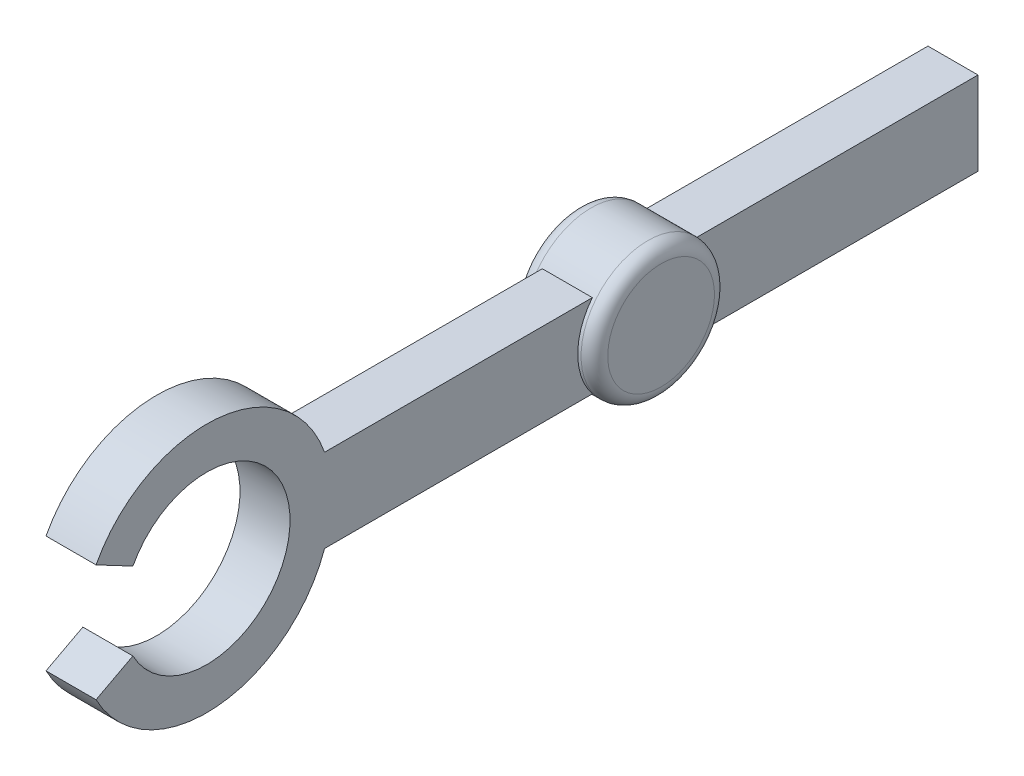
ISO-10303-21;
HEADER;
FILE_DESCRIPTION(('STEP AP214'),'2;1');
FILE_NAME('part.step','',(''),(''),'','','');
FILE_SCHEMA(('AUTOMOTIVE_DESIGN { 1 0 10303 214 1 1 1 1 }'));
ENDSEC;
DATA;
#1=APPLICATION_CONTEXT('core data for automotive mechanical design processes');
#2=APPLICATION_PROTOCOL_DEFINITION('international standard','automotive_design',2000,#1);
#3=PRODUCT_CONTEXT('',#1,'mechanical');
#4=PRODUCT('Part','Part','',(#3));
#5=PRODUCT_RELATED_PRODUCT_CATEGORY('part','',(#4));
#6=PRODUCT_DEFINITION_FORMATION('','',#4);
#7=PRODUCT_DEFINITION_CONTEXT('part definition',#1,'design');
#8=PRODUCT_DEFINITION('design','',#6,#7);
#9=PRODUCT_DEFINITION_SHAPE('','',#8);
#10=(LENGTH_UNIT() NAMED_UNIT(*) SI_UNIT(.MILLI.,.METRE.));
#11=(NAMED_UNIT(*) PLANE_ANGLE_UNIT() SI_UNIT($,.RADIAN.));
#12=(NAMED_UNIT(*) SI_UNIT($,.STERADIAN.) SOLID_ANGLE_UNIT());
#13=UNCERTAINTY_MEASURE_WITH_UNIT(LENGTH_MEASURE(1.E-05),#10,'distance_accuracy_value','');
#14=(GEOMETRIC_REPRESENTATION_CONTEXT(3) GLOBAL_UNCERTAINTY_ASSIGNED_CONTEXT((#13)) GLOBAL_UNIT_ASSIGNED_CONTEXT((#10,
#11,#12)) REPRESENTATION_CONTEXT('',''));
#15=CARTESIAN_POINT('',(0.,0.,0.));
#16=DIRECTION('',(0.,0.,1.));
#17=DIRECTION('',(1.,0.,0.));
#18=AXIS2_PLACEMENT_3D('',#15,#16,#17);
#19=CARTESIAN_POINT('',(-3.81,6.35,-50.8));
#20=DIRECTION('',(0.,1.,0.));
#21=DIRECTION('',(0.,0.,1.));
#22=AXIS2_PLACEMENT_3D('',#19,#20,#21);
#23=PLANE('',#22);
#24=DIRECTION('',(0.,0.,1.));
#25=VECTOR('',#24,1.);
#26=CARTESIAN_POINT('',(-3.81,6.35,-50.8));
#27=LINE('',#26,#25);
#28=CARTESIAN_POINT('',(-3.81,6.35,7.93114745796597));
#29=VERTEX_POINT('',#28);
#30=CARTESIAN_POINT('',(-3.81,6.35,48.7144877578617));
#31=VERTEX_POINT('',#30);
#32=EDGE_CURVE('E183',#29,#31,#27,.T.);
#33=ORIENTED_EDGE('',*,*,#32,.T.);
#34=DIRECTION('',(-1.,0.,0.));
#35=VECTOR('',#34,1.);
#36=CARTESIAN_POINT('',(3.81,6.35,48.7144877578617));
#37=LINE('',#36,#35);
#38=CARTESIAN_POINT('',(3.81,6.35,48.7144877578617));
#39=VERTEX_POINT('',#38);
#40=EDGE_CURVE('E155',#31,#39,#37,.F.);
#41=ORIENTED_EDGE('',*,*,#40,.T.);
#42=DIRECTION('',(0.,0.,1.));
#43=VECTOR('',#42,1.);
#44=CARTESIAN_POINT('',(3.81,6.35,-50.8));
#45=LINE('',#44,#43);
#46=CARTESIAN_POINT('',(3.81,6.35,7.93114745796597));
#47=VERTEX_POINT('',#46);
#48=EDGE_CURVE('E64',#47,#39,#45,.T.);
#49=ORIENTED_EDGE('',*,*,#48,.F.);
#50=DIRECTION('',(-1.,0.,0.));
#51=VECTOR('',#50,1.);
#52=CARTESIAN_POINT('',(6.35,6.35,7.93114745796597));
#53=LINE('',#52,#51);
#54=EDGE_CURVE('E176',#29,#47,#53,.F.);
#55=ORIENTED_EDGE('',*,*,#54,.F.);
#56=EDGE_LOOP('',(#33,#41,#49,#55));
#57=FACE_BOUND('',#56,.T.);
#58=ADVANCED_FACE('F41',(#57),#23,.T.);
#59=CARTESIAN_POINT('',(-3.81,-6.35,-50.8));
#60=DIRECTION('',(0.,-1.,0.));
#61=DIRECTION('',(0.,0.,-1.));
#62=AXIS2_PLACEMENT_3D('',#59,#60,#61);
#63=PLANE('',#62);
#64=DIRECTION('',(0.,0.,1.));
#65=VECTOR('',#64,1.);
#66=CARTESIAN_POINT('',(3.81,-6.35,-50.8));
#67=LINE('',#66,#65);
#68=CARTESIAN_POINT('',(3.81,-6.35,7.93114745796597));
#69=VERTEX_POINT('',#68);
#70=CARTESIAN_POINT('',(3.81,-6.35,48.7144877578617));
#71=VERTEX_POINT('',#70);
#72=EDGE_CURVE('E177',#69,#71,#67,.T.);
#73=ORIENTED_EDGE('',*,*,#72,.T.);
#74=DIRECTION('',(-1.,0.,0.));
#75=VECTOR('',#74,1.);
#76=CARTESIAN_POINT('',(3.81,-6.35,48.7144877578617));
#77=LINE('',#76,#75);
#78=CARTESIAN_POINT('',(-3.81,-6.35,48.7144877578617));
#79=VERTEX_POINT('',#78);
#80=EDGE_CURVE('E152',#71,#79,#77,.T.);
#81=ORIENTED_EDGE('',*,*,#80,.T.);
#82=DIRECTION('',(0.,0.,1.));
#83=VECTOR('',#82,1.);
#84=CARTESIAN_POINT('',(-3.81,-6.35,-50.8));
#85=LINE('',#84,#83);
#86=CARTESIAN_POINT('',(-3.81,-6.35,7.93114745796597));
#87=VERTEX_POINT('',#86);
#88=EDGE_CURVE('E181',#87,#79,#85,.T.);
#89=ORIENTED_EDGE('',*,*,#88,.F.);
#90=DIRECTION('',(-1.,0.,0.));
#91=VECTOR('',#90,1.);
#92=CARTESIAN_POINT('',(6.35,-6.35,7.93114745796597));
#93=LINE('',#92,#91);
#94=EDGE_CURVE('E192',#69,#87,#93,.T.);
#95=ORIENTED_EDGE('',*,*,#94,.F.);
#96=EDGE_LOOP('',(#73,#81,#89,#95));
#97=FACE_BOUND('',#96,.T.);
#98=ADVANCED_FACE('F226',(#97),#63,.T.);
#99=CARTESIAN_POINT('',(6.35,0.,0.));
#100=DIRECTION('',(-1.,0.,0.));
#101=DIRECTION('',(0.,0.,1.));
#102=AXIS2_PLACEMENT_3D('',#99,#100,#101);
#103=CYLINDRICAL_SURFACE('',#102,10.16);
#104=CARTESIAN_POINT('',(-4.318,0.,0.));
#105=DIRECTION('',(1.,0.,0.));
#106=DIRECTION('',(0.,0.,-1.));
#107=AXIS2_PLACEMENT_3D('',#104,#105,#106);
#108=CIRCLE('',#107,10.16);
#109=CARTESIAN_POINT('',(-4.318,0.,-10.16));
#110=VERTEX_POINT('',#109);
#111=EDGE_CURVE('E209',#110,#110,#108,.T.);
#112=ORIENTED_EDGE('',*,*,#111,.T.);
#113=EDGE_LOOP('',(#112));
#114=FACE_BOUND('',#113,.T.);
#115=CARTESIAN_POINT('',(4.318,0.,0.));
#116=DIRECTION('',(1.,0.,0.));
#117=DIRECTION('',(0.,0.,-1.));
#118=AXIS2_PLACEMENT_3D('',#115,#116,#117);
#119=CIRCLE('',#118,10.16);
#120=CARTESIAN_POINT('',(4.318,0.,-10.16));
#121=VERTEX_POINT('',#120);
#122=EDGE_CURVE('E206',#121,#121,#119,.F.);
#123=ORIENTED_EDGE('',*,*,#122,.T.);
#124=EDGE_LOOP('',(#123));
#125=FACE_BOUND('',#124,.T.);
#126=DIRECTION('',(-1.,0.,0.));
#127=VECTOR('',#126,1.);
#128=CARTESIAN_POINT('',(6.35,-6.35,-7.93114745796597));
#129=LINE('',#128,#127);
#130=CARTESIAN_POINT('',(-3.81,-6.35,-7.93114745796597));
#131=VERTEX_POINT('',#130);
#132=CARTESIAN_POINT('',(3.81,-6.35,-7.93114745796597));
#133=VERTEX_POINT('',#132);
#134=EDGE_CURVE('E203',#131,#133,#129,.F.);
#135=ORIENTED_EDGE('',*,*,#134,.T.);
#136=CARTESIAN_POINT('',(3.81,0.,0.));
#137=DIRECTION('',(1.,0.,0.));
#138=DIRECTION('',(0.,1.,0.));
#139=AXIS2_PLACEMENT_3D('',#136,#137,#138);
#140=CIRCLE('',#139,10.16);
#141=CARTESIAN_POINT('',(3.81,6.35,-7.93114745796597));
#142=VERTEX_POINT('',#141);
#143=EDGE_CURVE('E200',#133,#142,#140,.T.);
#144=ORIENTED_EDGE('',*,*,#143,.T.);
#145=DIRECTION('',(-1.,0.,0.));
#146=VECTOR('',#145,1.);
#147=CARTESIAN_POINT('',(6.35,6.35,-7.93114745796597));
#148=LINE('',#147,#146);
#149=CARTESIAN_POINT('',(-3.81,6.35,-7.93114745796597));
#150=VERTEX_POINT('',#149);
#151=EDGE_CURVE('E199',#142,#150,#148,.T.);
#152=ORIENTED_EDGE('',*,*,#151,.T.);
#153=CARTESIAN_POINT('',(-3.81,0.,0.));
#154=DIRECTION('',(-1.,0.,0.));
#155=DIRECTION('',(0.,-1.,0.));
#156=AXIS2_PLACEMENT_3D('',#153,#154,#155);
#157=CIRCLE('',#156,10.16);
#158=EDGE_CURVE('E193',#150,#131,#157,.T.);
#159=ORIENTED_EDGE('',*,*,#158,.T.);
#160=EDGE_LOOP('',(#135,#144,#152,#159));
#161=FACE_BOUND('',#160,.T.);
#162=ORIENTED_EDGE('',*,*,#54,.T.);
#163=EDGE_CURVE('E196',#47,#69,#140,.T.);
#164=ORIENTED_EDGE('',*,*,#163,.T.);
#165=ORIENTED_EDGE('',*,*,#94,.T.);
#166=EDGE_CURVE('E189',#87,#29,#157,.T.);
#167=ORIENTED_EDGE('',*,*,#166,.T.);
#168=EDGE_LOOP('',(#162,#164,#165,#167));
#169=FACE_BOUND('',#168,.T.);
#170=ADVANCED_FACE('F222',(#114,#125,#161,#169),#103,.T.);
#171=CARTESIAN_POINT('',(6.35,0.,0.));
#172=DIRECTION('',(1.,0.,0.));
#173=DIRECTION('',(0.,0.,-1.));
#174=AXIS2_PLACEMENT_3D('',#171,#172,#173);
#175=PLANE('',#174);
#176=CARTESIAN_POINT('',(6.35,0.,0.));
#177=DIRECTION('',(1.,0.,0.));
#178=DIRECTION('',(0.,0.,-1.));
#179=AXIS2_PLACEMENT_3D('',#176,#177,#178);
#180=CIRCLE('',#179,8.128);
#181=CARTESIAN_POINT('',(6.35,0.,-8.128));
#182=VERTEX_POINT('',#181);
#183=EDGE_CURVE('E11',#182,#182,#180,.T.);
#184=ORIENTED_EDGE('',*,*,#183,.T.);
#185=EDGE_LOOP('',(#184));
#186=FACE_BOUND('',#185,.T.);
#187=ADVANCED_FACE('F225',(#186),#175,.T.);
#188=CARTESIAN_POINT('',(-6.35,0.,0.));
#189=DIRECTION('',(1.,0.,0.));
#190=DIRECTION('',(0.,0.,-1.));
#191=AXIS2_PLACEMENT_3D('',#188,#189,#190);
#192=PLANE('',#191);
#193=CARTESIAN_POINT('',(-6.35,0.,0.));
#194=DIRECTION('',(1.,0.,0.));
#195=DIRECTION('',(0.,0.,-1.));
#196=AXIS2_PLACEMENT_3D('',#193,#194,#195);
#197=CIRCLE('',#196,8.128);
#198=CARTESIAN_POINT('',(-6.35,0.,-8.128));
#199=VERTEX_POINT('',#198);
#200=EDGE_CURVE('E49',#199,#199,#197,.F.);
#201=ORIENTED_EDGE('',*,*,#200,.T.);
#202=EDGE_LOOP('',(#201));
#203=FACE_BOUND('',#202,.T.);
#204=ADVANCED_FACE('F214',(#203),#192,.F.);
#205=CARTESIAN_POINT('',(-3.81,6.35,-50.8));
#206=DIRECTION('',(-1.,0.,0.));
#207=DIRECTION('',(0.,-1.,0.));
#208=AXIS2_PLACEMENT_3D('',#205,#206,#207);
#209=PLANE('',#208);
#210=CARTESIAN_POINT('',(-3.81,0.,66.675));
#211=DIRECTION('',(1.,0.,0.));
#212=DIRECTION('',(0.,0.,-1.));
#213=AXIS2_PLACEMENT_3D('',#210,#211,#212);
#214=CIRCLE('',#213,19.05);
#215=CARTESIAN_POINT('',(-3.81,8.88999999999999,83.5234539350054));
#216=VERTEX_POINT('',#215);
#217=EDGE_CURVE('E150',#31,#216,#214,.T.);
#218=ORIENTED_EDGE('',*,*,#217,.F.);
#219=ORIENTED_EDGE('',*,*,#32,.F.);
#220=ORIENTED_EDGE('',*,*,#166,.F.);
#221=ORIENTED_EDGE('',*,*,#88,.T.);
#222=CARTESIAN_POINT('',(-3.81,-8.89,83.5234539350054));
#223=VERTEX_POINT('',#222);
#224=EDGE_CURVE('E241',#223,#79,#214,.T.);
#225=ORIENTED_EDGE('',*,*,#224,.F.);
#226=DIRECTION('',(0.,-0.466666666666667,0.884433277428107));
#227=VECTOR('',#226,1.);
#228=CARTESIAN_POINT('',(-3.81,-8.89,83.5234539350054));
#229=LINE('',#228,#227);
#230=CARTESIAN_POINT('',(-3.81,-5.92666666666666,77.9073026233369));
#231=VERTEX_POINT('',#230);
#232=EDGE_CURVE('E137',#231,#223,#229,.T.);
#233=ORIENTED_EDGE('',*,*,#232,.F.);
#234=CARTESIAN_POINT('',(-3.81,0.,66.675));
#235=DIRECTION('',(-1.,0.,0.));
#236=DIRECTION('',(0.,0.,-1.));
#237=AXIS2_PLACEMENT_3D('',#234,#235,#236);
#238=CIRCLE('',#237,12.7);
#239=CARTESIAN_POINT('',(-3.81,5.92666666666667,77.9073026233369));
#240=VERTEX_POINT('',#239);
#241=EDGE_CURVE('E248',#240,#231,#238,.T.);
#242=ORIENTED_EDGE('',*,*,#241,.F.);
#243=DIRECTION('',(0.,-0.466666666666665,-0.884433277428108));
#244=VECTOR('',#243,1.);
#245=CARTESIAN_POINT('',(-3.81,8.88999999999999,83.5234539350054));
#246=LINE('',#245,#244);
#247=EDGE_CURVE('E240',#216,#240,#246,.T.);
#248=ORIENTED_EDGE('',*,*,#247,.F.);
#249=EDGE_LOOP('',(#218,#219,#220,#221,#225,#233,#242,#248));
#250=FACE_BOUND('',#249,.T.);
#251=ADVANCED_FACE('F236',(#250),#209,.T.);
#252=CARTESIAN_POINT('',(3.81,6.35,-50.8));
#253=DIRECTION('',(1.,0.,0.));
#254=DIRECTION('',(0.,1.,0.));
#255=AXIS2_PLACEMENT_3D('',#252,#253,#254);
#256=PLANE('',#255);
#257=ORIENTED_EDGE('',*,*,#48,.T.);
#258=CARTESIAN_POINT('',(3.81,0.,66.675));
#259=DIRECTION('',(1.,0.,0.));
#260=DIRECTION('',(0.,0.,-1.));
#261=AXIS2_PLACEMENT_3D('',#258,#259,#260);
#262=CIRCLE('',#261,19.05);
#263=CARTESIAN_POINT('',(3.81,8.88999999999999,83.5234539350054));
#264=VERTEX_POINT('',#263);
#265=EDGE_CURVE('E129',#39,#264,#262,.T.);
#266=ORIENTED_EDGE('',*,*,#265,.T.);
#267=DIRECTION('',(0.,-0.466666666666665,-0.884433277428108));
#268=VECTOR('',#267,1.);
#269=CARTESIAN_POINT('',(3.81,8.88999999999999,83.5234539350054));
#270=LINE('',#269,#268);
#271=CARTESIAN_POINT('',(3.81,5.92666666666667,77.9073026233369));
#272=VERTEX_POINT('',#271);
#273=EDGE_CURVE('E132',#264,#272,#270,.T.);
#274=ORIENTED_EDGE('',*,*,#273,.T.);
#275=CARTESIAN_POINT('',(3.81,0.,66.675));
#276=DIRECTION('',(-1.,0.,0.));
#277=DIRECTION('',(0.,0.,-1.));
#278=AXIS2_PLACEMENT_3D('',#275,#276,#277);
#279=CIRCLE('',#278,12.7);
#280=CARTESIAN_POINT('',(3.81,-5.92666666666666,77.9073026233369));
#281=VERTEX_POINT('',#280);
#282=EDGE_CURVE('E146',#272,#281,#279,.T.);
#283=ORIENTED_EDGE('',*,*,#282,.T.);
#284=DIRECTION('',(0.,-0.466666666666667,0.884433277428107));
#285=VECTOR('',#284,1.);
#286=CARTESIAN_POINT('',(3.81,-8.89,83.5234539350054));
#287=LINE('',#286,#285);
#288=CARTESIAN_POINT('',(3.81,-8.89,83.5234539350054));
#289=VERTEX_POINT('',#288);
#290=EDGE_CURVE('E245',#281,#289,#287,.T.);
#291=ORIENTED_EDGE('',*,*,#290,.T.);
#292=EDGE_CURVE('E136',#289,#71,#262,.T.);
#293=ORIENTED_EDGE('',*,*,#292,.T.);
#294=ORIENTED_EDGE('',*,*,#72,.F.);
#295=ORIENTED_EDGE('',*,*,#163,.F.);
#296=EDGE_LOOP('',(#257,#266,#274,#283,#291,#293,#294,#295));
#297=FACE_BOUND('',#296,.T.);
#298=ADVANCED_FACE('F131',(#297),#256,.T.);
#299=ORIENTED_EDGE('',*,*,#134,.F.);
#300=CARTESIAN_POINT('',(-3.81,-6.35,-50.8));
#301=VERTEX_POINT('',#300);
#302=EDGE_CURVE('E178',#301,#131,#85,.T.);
#303=ORIENTED_EDGE('',*,*,#302,.F.);
#304=DIRECTION('',(1.,0.,0.));
#305=VECTOR('',#304,1.);
#306=CARTESIAN_POINT('',(-3.81,-6.35,-50.8));
#307=LINE('',#306,#305);
#308=CARTESIAN_POINT('',(3.81,-6.35,-50.8));
#309=VERTEX_POINT('',#308);
#310=EDGE_CURVE('E170',#301,#309,#307,.T.);
#311=ORIENTED_EDGE('',*,*,#310,.T.);
#312=EDGE_CURVE('E173',#309,#133,#67,.T.);
#313=ORIENTED_EDGE('',*,*,#312,.T.);
#314=EDGE_LOOP('',(#299,#303,#311,#313));
#315=FACE_BOUND('',#314,.T.);
#316=ADVANCED_FACE('F286',(#315),#63,.T.);
#317=ORIENTED_EDGE('',*,*,#151,.F.);
#318=CARTESIAN_POINT('',(3.81,6.35,-50.8));
#319=VERTEX_POINT('',#318);
#320=EDGE_CURVE('E184',#319,#142,#45,.T.);
#321=ORIENTED_EDGE('',*,*,#320,.F.);
#322=DIRECTION('',(-1.,0.,0.));
#323=VECTOR('',#322,1.);
#324=CARTESIAN_POINT('',(-3.81,6.35,-50.8));
#325=LINE('',#324,#323);
#326=CARTESIAN_POINT('',(-3.81,6.35,-50.8));
#327=VERTEX_POINT('',#326);
#328=EDGE_CURVE('E165',#319,#327,#325,.T.);
#329=ORIENTED_EDGE('',*,*,#328,.T.);
#330=EDGE_CURVE('E56',#327,#150,#27,.T.);
#331=ORIENTED_EDGE('',*,*,#330,.T.);
#332=EDGE_LOOP('',(#317,#321,#329,#331));
#333=FACE_BOUND('',#332,.T.);
#334=ADVANCED_FACE('F280',(#333),#23,.T.);
#335=ORIENTED_EDGE('',*,*,#143,.F.);
#336=ORIENTED_EDGE('',*,*,#312,.F.);
#337=DIRECTION('',(0.,1.,0.));
#338=VECTOR('',#337,1.);
#339=CARTESIAN_POINT('',(3.81,6.35,-50.8));
#340=LINE('',#339,#338);
#341=EDGE_CURVE('E162',#309,#319,#340,.T.);
#342=ORIENTED_EDGE('',*,*,#341,.T.);
#343=ORIENTED_EDGE('',*,*,#320,.T.);
#344=EDGE_LOOP('',(#335,#336,#342,#343));
#345=FACE_BOUND('',#344,.T.);
#346=ADVANCED_FACE('F290',(#345),#256,.T.);
#347=ORIENTED_EDGE('',*,*,#158,.F.);
#348=ORIENTED_EDGE('',*,*,#330,.F.);
#349=DIRECTION('',(0.,-1.,0.));
#350=VECTOR('',#349,1.);
#351=CARTESIAN_POINT('',(-3.81,6.35,-50.8));
#352=LINE('',#351,#350);
#353=EDGE_CURVE('E167',#327,#301,#352,.T.);
#354=ORIENTED_EDGE('',*,*,#353,.T.);
#355=ORIENTED_EDGE('',*,*,#302,.T.);
#356=EDGE_LOOP('',(#347,#348,#354,#355));
#357=FACE_BOUND('',#356,.T.);
#358=ADVANCED_FACE('F295',(#357),#209,.T.);
#359=CARTESIAN_POINT('',(0.,0.,-50.8));
#360=DIRECTION('',(0.,0.,1.));
#361=DIRECTION('',(1.,0.,0.));
#362=AXIS2_PLACEMENT_3D('',#359,#360,#361);
#363=PLANE('',#362);
#364=ORIENTED_EDGE('',*,*,#341,.F.);
#365=ORIENTED_EDGE('',*,*,#310,.F.);
#366=ORIENTED_EDGE('',*,*,#353,.F.);
#367=ORIENTED_EDGE('',*,*,#328,.F.);
#368=EDGE_LOOP('',(#364,#365,#366,#367));
#369=FACE_BOUND('',#368,.T.);
#370=ADVANCED_FACE('F219',(#369),#363,.F.);
#371=CARTESIAN_POINT('',(-4.318,0.,0.));
#372=DIRECTION('',(1.,0.,0.));
#373=DIRECTION('',(0.,0.,-1.));
#374=AXIS2_PLACEMENT_3D('',#371,#372,#373);
#375=TOROIDAL_SURFACE('',#374,8.128,2.032);
#376=ORIENTED_EDGE('',*,*,#200,.F.);
#377=EDGE_LOOP('',(#376));
#378=FACE_BOUND('',#377,.T.);
#379=ORIENTED_EDGE('',*,*,#111,.F.);
#380=EDGE_LOOP('',(#379));
#381=FACE_BOUND('',#380,.T.);
#382=ADVANCED_FACE('F216',(#378,#381),#375,.T.);
#383=CARTESIAN_POINT('',(4.318,0.,0.));
#384=DIRECTION('',(1.,0.,0.));
#385=DIRECTION('',(0.,0.,-1.));
#386=AXIS2_PLACEMENT_3D('',#383,#384,#385);
#387=TOROIDAL_SURFACE('',#386,8.128,2.032);
#388=ORIENTED_EDGE('',*,*,#122,.F.);
#389=EDGE_LOOP('',(#388));
#390=FACE_BOUND('',#389,.T.);
#391=ORIENTED_EDGE('',*,*,#183,.F.);
#392=EDGE_LOOP('',(#391));
#393=FACE_BOUND('',#392,.T.);
#394=ADVANCED_FACE('F43',(#390,#393),#387,.T.);
#395=CARTESIAN_POINT('',(3.81,0.,66.675));
#396=DIRECTION('',(-1.,0.,0.));
#397=DIRECTION('',(0.,0.,1.));
#398=AXIS2_PLACEMENT_3D('',#395,#396,#397);
#399=CYLINDRICAL_SURFACE('',#398,19.05);
#400=ORIENTED_EDGE('',*,*,#40,.F.);
#401=ORIENTED_EDGE('',*,*,#217,.T.);
#402=DIRECTION('',(-1.,0.,0.));
#403=VECTOR('',#402,1.);
#404=CARTESIAN_POINT('',(3.81,8.88999999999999,83.5234539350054));
#405=LINE('',#404,#403);
#406=EDGE_CURVE('E142',#264,#216,#405,.T.);
#407=ORIENTED_EDGE('',*,*,#406,.F.);
#408=ORIENTED_EDGE('',*,*,#265,.F.);
#409=EDGE_LOOP('',(#400,#401,#407,#408));
#410=FACE_BOUND('',#409,.T.);
#411=ADVANCED_FACE('F148',(#410),#399,.T.);
#412=ORIENTED_EDGE('',*,*,#80,.F.);
#413=ORIENTED_EDGE('',*,*,#292,.F.);
#414=DIRECTION('',(-1.,0.,0.));
#415=VECTOR('',#414,1.);
#416=CARTESIAN_POINT('',(3.81,-8.89,83.5234539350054));
#417=LINE('',#416,#415);
#418=EDGE_CURVE('E251',#289,#223,#417,.T.);
#419=ORIENTED_EDGE('',*,*,#418,.T.);
#420=ORIENTED_EDGE('',*,*,#224,.T.);
#421=EDGE_LOOP('',(#412,#413,#419,#420));
#422=FACE_BOUND('',#421,.T.);
#423=ADVANCED_FACE('F263',(#422),#399,.T.);
#424=CARTESIAN_POINT('',(3.81,8.88999999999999,83.5234539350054));
#425=DIRECTION('',(0.,0.884433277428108,-0.466666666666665));
#426=DIRECTION('',(0.,0.466666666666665,0.884433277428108));
#427=AXIS2_PLACEMENT_3D('',#424,#425,#426);
#428=PLANE('',#427);
#429=ORIENTED_EDGE('',*,*,#247,.T.);
#430=DIRECTION('',(-1.,0.,0.));
#431=VECTOR('',#430,1.);
#432=CARTESIAN_POINT('',(3.81,5.92666666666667,77.9073026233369));
#433=LINE('',#432,#431);
#434=EDGE_CURVE('E144',#272,#240,#433,.T.);
#435=ORIENTED_EDGE('',*,*,#434,.F.);
#436=ORIENTED_EDGE('',*,*,#273,.F.);
#437=ORIENTED_EDGE('',*,*,#406,.T.);
#438=EDGE_LOOP('',(#429,#435,#436,#437));
#439=FACE_BOUND('',#438,.T.);
#440=ADVANCED_FACE('F141',(#439),#428,.F.);
#441=CARTESIAN_POINT('',(3.81,0.,66.675));
#442=DIRECTION('',(-1.,0.,0.));
#443=DIRECTION('',(0.,0.,1.));
#444=AXIS2_PLACEMENT_3D('',#441,#442,#443);
#445=CYLINDRICAL_SURFACE('',#444,12.7);
#446=ORIENTED_EDGE('',*,*,#241,.T.);
#447=DIRECTION('',(-1.,0.,0.));
#448=VECTOR('',#447,1.);
#449=CARTESIAN_POINT('',(3.81,-5.92666666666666,77.9073026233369));
#450=LINE('',#449,#448);
#451=EDGE_CURVE('E157',#281,#231,#450,.T.);
#452=ORIENTED_EDGE('',*,*,#451,.F.);
#453=ORIENTED_EDGE('',*,*,#282,.F.);
#454=ORIENTED_EDGE('',*,*,#434,.T.);
#455=EDGE_LOOP('',(#446,#452,#453,#454));
#456=FACE_BOUND('',#455,.T.);
#457=ADVANCED_FACE('F269',(#456),#445,.F.);
#458=CARTESIAN_POINT('',(3.81,-8.89,83.5234539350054));
#459=DIRECTION('',(0.,-0.884433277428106,-0.466666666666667));
#460=DIRECTION('',(0.,0.466666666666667,-0.884433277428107));
#461=AXIS2_PLACEMENT_3D('',#458,#459,#460);
#462=PLANE('',#461);
#463=ORIENTED_EDGE('',*,*,#232,.T.);
#464=ORIENTED_EDGE('',*,*,#418,.F.);
#465=ORIENTED_EDGE('',*,*,#290,.F.);
#466=ORIENTED_EDGE('',*,*,#451,.T.);
#467=EDGE_LOOP('',(#463,#464,#465,#466));
#468=FACE_BOUND('',#467,.T.);
#469=ADVANCED_FACE('F258',(#468),#462,.F.);
#470=CLOSED_SHELL('',(#58,#98,#170,#187,#204,#251,#298,#316,#334,#346,#358,#370,#382,#394,#411,
#423,#440,#457,#469));
#471=MANIFOLD_SOLID_BREP('B2',#470);
#472=ADVANCED_BREP_SHAPE_REPRESENTATION('',(#18,#471),#14);
#473=SHAPE_DEFINITION_REPRESENTATION(#9,#472);
ENDSEC;
END-ISO-10303-21;
